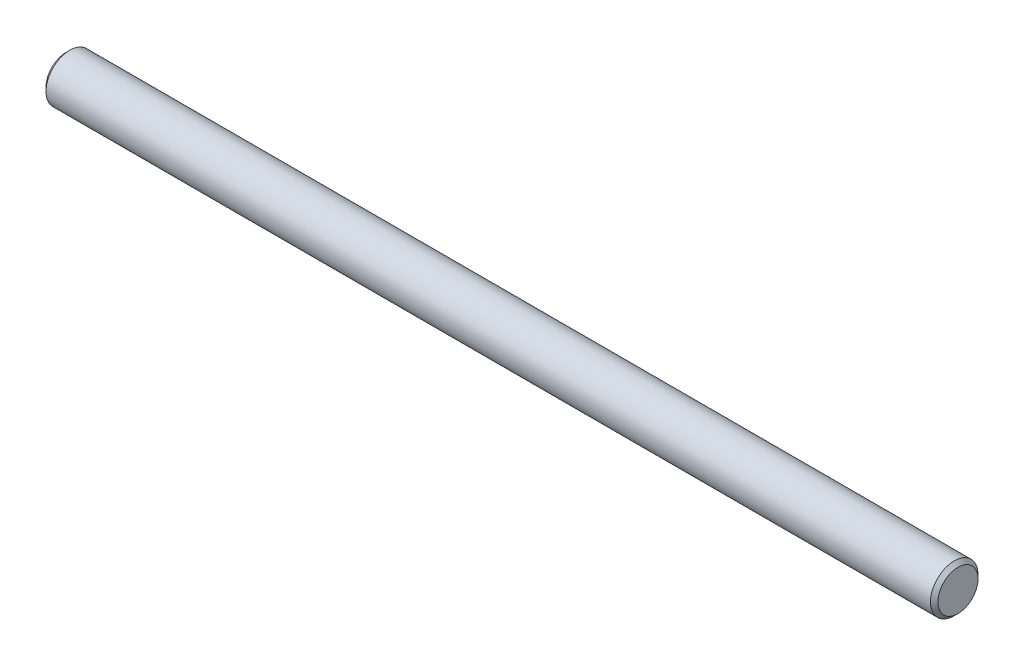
ISO-10303-21;
HEADER;
FILE_DESCRIPTION(('STEP AP214'),'2;1');
FILE_NAME('part.step','',(''),(''),'','','');
FILE_SCHEMA(('AUTOMOTIVE_DESIGN { 1 0 10303 214 1 1 1 1 }'));
ENDSEC;
DATA;
#1=APPLICATION_CONTEXT('core data for automotive mechanical design processes');
#2=APPLICATION_PROTOCOL_DEFINITION('international standard','automotive_design',2000,#1);
#3=PRODUCT_CONTEXT('',#1,'mechanical');
#4=PRODUCT('Part','Part','',(#3));
#5=PRODUCT_RELATED_PRODUCT_CATEGORY('part','',(#4));
#6=PRODUCT_DEFINITION_FORMATION('','',#4);
#7=PRODUCT_DEFINITION_CONTEXT('part definition',#1,'design');
#8=PRODUCT_DEFINITION('design','',#6,#7);
#9=PRODUCT_DEFINITION_SHAPE('','',#8);
#10=(LENGTH_UNIT() NAMED_UNIT(*) SI_UNIT(.MILLI.,.METRE.));
#11=(NAMED_UNIT(*) PLANE_ANGLE_UNIT() SI_UNIT($,.RADIAN.));
#12=(NAMED_UNIT(*) SI_UNIT($,.STERADIAN.) SOLID_ANGLE_UNIT());
#13=UNCERTAINTY_MEASURE_WITH_UNIT(LENGTH_MEASURE(1.E-05),#10,'distance_accuracy_value','');
#14=(GEOMETRIC_REPRESENTATION_CONTEXT(3) GLOBAL_UNCERTAINTY_ASSIGNED_CONTEXT((#13)) GLOBAL_UNIT_ASSIGNED_CONTEXT((#10,
#11,#12)) REPRESENTATION_CONTEXT('',''));
#15=CARTESIAN_POINT('',(0.,0.,0.));
#16=DIRECTION('',(0.,0.,1.));
#17=DIRECTION('',(1.,0.,0.));
#18=AXIS2_PLACEMENT_3D('',#15,#16,#17);
#19=CARTESIAN_POINT('',(0.,0.,0.));
#20=DIRECTION('',(1.,0.,0.));
#21=DIRECTION('',(0.,0.,-1.));
#22=AXIS2_PLACEMENT_3D('',#19,#20,#21);
#23=PLANE('',#22);
#24=CARTESIAN_POINT('',(0.,0.,0.));
#25=DIRECTION('',(1.,0.,0.));
#26=DIRECTION('',(0.,0.,-1.));
#27=AXIS2_PLACEMENT_3D('',#24,#25,#26);
#28=CIRCLE('',#27,3.37499999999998);
#29=CARTESIAN_POINT('',(0.,0.,-3.37499999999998));
#30=VERTEX_POINT('',#29);
#31=EDGE_CURVE('E10',#30,#30,#28,.F.);
#32=ORIENTED_EDGE('',*,*,#31,.T.);
#33=EDGE_LOOP('',(#32));
#34=FACE_BOUND('',#33,.T.);
#35=ADVANCED_FACE('F348',(#34),#23,.F.);
#36=CARTESIAN_POINT('',(0.,0.,0.));
#37=DIRECTION('',(-1.,0.,0.));
#38=DIRECTION('',(0.,0.,1.));
#39=AXIS2_PLACEMENT_3D('',#36,#37,#38);
#40=CYLINDRICAL_SURFACE('',#39,3.99999999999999);
#41=CARTESIAN_POINT('',(149.375,0.,0.));
#42=DIRECTION('',(-1.,0.,0.));
#43=DIRECTION('',(0.,0.,1.));
#44=AXIS2_PLACEMENT_3D('',#41,#42,#43);
#45=CIRCLE('',#44,3.99999999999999);
#46=CARTESIAN_POINT('',(149.375,0.,3.99999999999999));
#47=VERTEX_POINT('',#46);
#48=EDGE_CURVE('E358',#47,#47,#45,.T.);
#49=ORIENTED_EDGE('',*,*,#48,.T.);
#50=EDGE_LOOP('',(#49));
#51=FACE_BOUND('',#50,.T.);
#52=CARTESIAN_POINT('',(0.625000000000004,0.,0.));
#53=DIRECTION('',(1.,0.,0.));
#54=DIRECTION('',(0.,0.,-1.));
#55=AXIS2_PLACEMENT_3D('',#52,#53,#54);
#56=CIRCLE('',#55,3.99999999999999);
#57=CARTESIAN_POINT('',(0.625000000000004,0.,-3.99999999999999));
#58=VERTEX_POINT('',#57);
#59=EDGE_CURVE('E362',#58,#58,#56,.T.);
#60=ORIENTED_EDGE('',*,*,#59,.T.);
#61=EDGE_LOOP('',(#60));
#62=FACE_BOUND('',#61,.T.);
#63=ADVANCED_FACE('F368',(#51,#62),#40,.T.);
#64=CARTESIAN_POINT('',(150.,0.,0.));
#65=DIRECTION('',(-1.,0.,0.));
#66=DIRECTION('',(0.,0.,1.));
#67=AXIS2_PLACEMENT_3D('',#64,#65,#66);
#68=PLANE('',#67);
#69=CARTESIAN_POINT('',(150.,0.,0.));
#70=DIRECTION('',(-1.,0.,0.));
#71=DIRECTION('',(0.,0.,1.));
#72=AXIS2_PLACEMENT_3D('',#69,#70,#71);
#73=CIRCLE('',#72,3.37500000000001);
#74=CARTESIAN_POINT('',(150.,0.,3.37500000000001));
#75=VERTEX_POINT('',#74);
#76=EDGE_CURVE('E354',#75,#75,#73,.F.);
#77=ORIENTED_EDGE('',*,*,#76,.T.);
#78=EDGE_LOOP('',(#77));
#79=FACE_BOUND('',#78,.T.);
#80=ADVANCED_FACE('F378',(#79),#68,.F.);
#81=CARTESIAN_POINT('',(149.375,0.,0.));
#82=DIRECTION('',(-1.,0.,0.));
#83=DIRECTION('',(0.,0.,1.));
#84=AXIS2_PLACEMENT_3D('',#81,#82,#83);
#85=CONICAL_SURFACE('',#84,3.99999999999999,0.785398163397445);
#86=ORIENTED_EDGE('',*,*,#76,.F.);
#87=EDGE_LOOP('',(#86));
#88=FACE_BOUND('',#87,.T.);
#89=ORIENTED_EDGE('',*,*,#48,.F.);
#90=EDGE_LOOP('',(#89));
#91=FACE_BOUND('',#90,.T.);
#92=ADVANCED_FACE('F373',(#88,#91),#85,.T.);
#93=CARTESIAN_POINT('',(0.,0.,0.));
#94=DIRECTION('',(1.,0.,0.));
#95=DIRECTION('',(0.,0.,-1.));
#96=AXIS2_PLACEMENT_3D('',#93,#94,#95);
#97=CONICAL_SURFACE('',#96,3.37499999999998,0.785398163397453);
#98=ORIENTED_EDGE('',*,*,#59,.F.);
#99=EDGE_LOOP('',(#98));
#100=FACE_BOUND('',#99,.T.);
#101=ORIENTED_EDGE('',*,*,#31,.F.);
#102=EDGE_LOOP('',(#101));
#103=FACE_BOUND('',#102,.T.);
#104=ADVANCED_FACE('F370',(#100,#103),#97,.T.);
#105=CLOSED_SHELL('',(#35,#63,#80,#92,#104));
#106=MANIFOLD_SOLID_BREP('B2',#105);
#107=ADVANCED_BREP_SHAPE_REPRESENTATION('',(#18,#106),#14);
#108=SHAPE_DEFINITION_REPRESENTATION(#9,#107);
ENDSEC;
END-ISO-10303-21;
